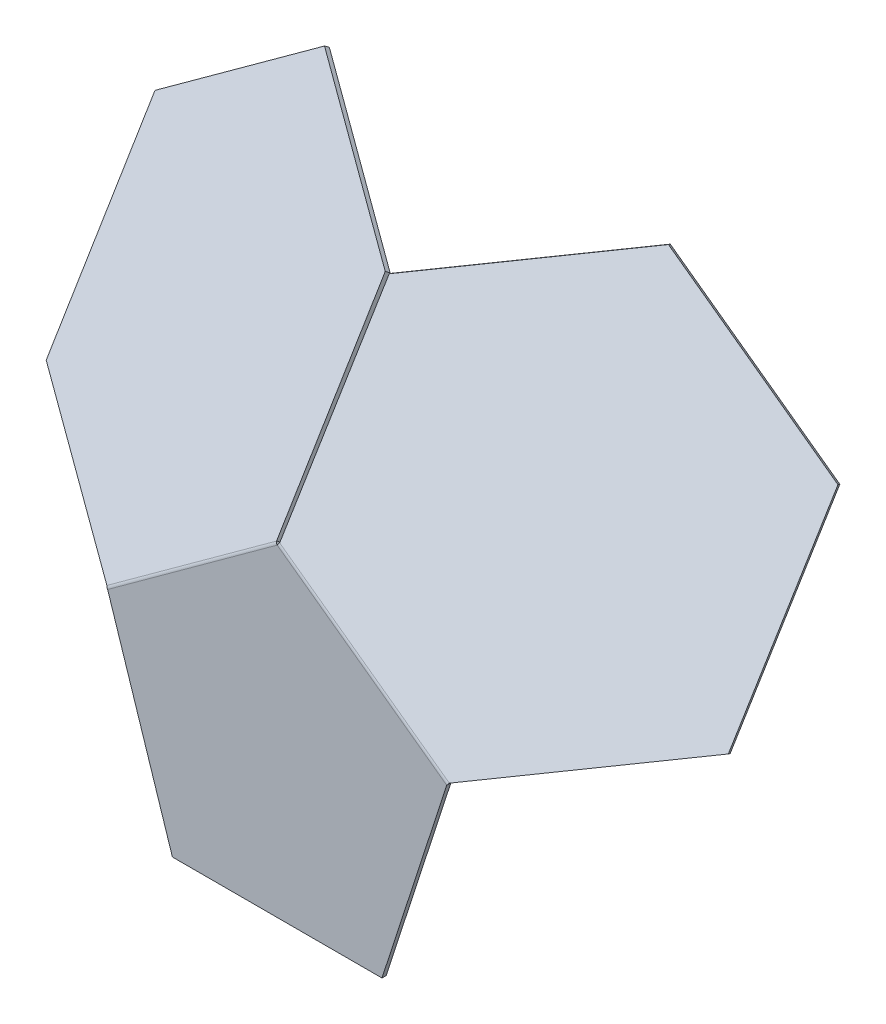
ISO-10303-21;
HEADER;
FILE_DESCRIPTION(('STEP AP214'),'2;1');
FILE_NAME('part.step','',(''),(''),'','','');
FILE_SCHEMA(('AUTOMOTIVE_DESIGN { 1 0 10303 214 1 1 1 1 }'));
ENDSEC;
DATA;
#1=APPLICATION_CONTEXT('core data for automotive mechanical design processes');
#2=APPLICATION_PROTOCOL_DEFINITION('international standard','automotive_design',2000,#1);
#3=PRODUCT_CONTEXT('',#1,'mechanical');
#4=PRODUCT('Part','Part','',(#3));
#5=PRODUCT_RELATED_PRODUCT_CATEGORY('part','',(#4));
#6=PRODUCT_DEFINITION_FORMATION('','',#4);
#7=PRODUCT_DEFINITION_CONTEXT('part definition',#1,'design');
#8=PRODUCT_DEFINITION('design','',#6,#7);
#9=PRODUCT_DEFINITION_SHAPE('','',#8);
#10=(LENGTH_UNIT() NAMED_UNIT(*) SI_UNIT(.MILLI.,.METRE.));
#11=(NAMED_UNIT(*) PLANE_ANGLE_UNIT() SI_UNIT($,.RADIAN.));
#12=(NAMED_UNIT(*) SI_UNIT($,.STERADIAN.) SOLID_ANGLE_UNIT());
#13=UNCERTAINTY_MEASURE_WITH_UNIT(LENGTH_MEASURE(1.E-05),#10,'distance_accuracy_value','');
#14=(GEOMETRIC_REPRESENTATION_CONTEXT(3) GLOBAL_UNCERTAINTY_ASSIGNED_CONTEXT((#13)) GLOBAL_UNIT_ASSIGNED_CONTEXT((#10,
#11,#12)) REPRESENTATION_CONTEXT('',''));
#15=CARTESIAN_POINT('',(0.,0.,0.));
#16=DIRECTION('',(0.,0.,1.));
#17=DIRECTION('',(1.,0.,0.));
#18=AXIS2_PLACEMENT_3D('',#15,#16,#17);
#19=CARTESIAN_POINT('',(-40.4508497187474,13.1432778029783,1.));
#20=DIRECTION('',(0.951056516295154,0.309016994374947,0.));
#21=DIRECTION('',(-0.309016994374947,0.951056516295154,0.));
#22=AXIS2_PLACEMENT_3D('',#19,#20,#21);
#23=PLANE('',#22);
#24=DIRECTION('',(0.309016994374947,-0.951056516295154,0.));
#25=VECTOR('',#24,1.);
#26=CARTESIAN_POINT('',(-40.4508497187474,13.1432778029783,0.));
#27=LINE('',#26,#25);
#28=CARTESIAN_POINT('',(-40.4508497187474,13.1432778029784,0.));
#29=VERTEX_POINT('',#28);
#30=CARTESIAN_POINT('',(-25.,-34.4095480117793,0.));
#31=VERTEX_POINT('',#30);
#32=EDGE_CURVE('E123',#29,#31,#27,.T.);
#33=ORIENTED_EDGE('',*,*,#32,.T.);
#34=DIRECTION('',(0.,0.,-1.));
#35=VECTOR('',#34,1.);
#36=CARTESIAN_POINT('',(-25.,-34.4095480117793,1.));
#37=LINE('',#36,#35);
#38=CARTESIAN_POINT('',(-25.,-34.4095480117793,1.));
#39=VERTEX_POINT('',#38);
#40=EDGE_CURVE('E176',#39,#31,#37,.T.);
#41=ORIENTED_EDGE('',*,*,#40,.F.);
#42=DIRECTION('',(0.309016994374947,-0.951056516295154,0.));
#43=VECTOR('',#42,1.);
#44=CARTESIAN_POINT('',(-40.4508497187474,13.1432778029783,1.));
#45=LINE('',#44,#43);
#46=CARTESIAN_POINT('',(-40.4508497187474,13.1432778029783,1.));
#47=VERTEX_POINT('',#46);
#48=EDGE_CURVE('E178',#47,#39,#45,.T.);
#49=ORIENTED_EDGE('',*,*,#48,.F.);
#50=DIRECTION('',(0.,0.,-1.));
#51=VECTOR('',#50,1.);
#52=CARTESIAN_POINT('',(-40.4508497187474,13.1432778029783,1.));
#53=LINE('',#52,#51);
#54=EDGE_CURVE('E103',#47,#29,#53,.T.);
#55=ORIENTED_EDGE('',*,*,#54,.T.);
#56=EDGE_LOOP('',(#33,#41,#49,#55));
#57=FACE_BOUND('',#56,.T.);
#58=ADVANCED_FACE('F95',(#57),#23,.F.);
#59=CARTESIAN_POINT('',(-25.,-34.4095480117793,1.));
#60=DIRECTION('',(0.,1.,0.));
#61=DIRECTION('',(0.,0.,1.));
#62=AXIS2_PLACEMENT_3D('',#59,#60,#61);
#63=PLANE('',#62);
#64=DIRECTION('',(1.,0.,0.));
#65=VECTOR('',#64,1.);
#66=CARTESIAN_POINT('',(-25.,-34.4095480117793,0.));
#67=LINE('',#66,#65);
#68=CARTESIAN_POINT('',(25.,-34.4095480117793,0.));
#69=VERTEX_POINT('',#68);
#70=EDGE_CURVE('E195',#31,#69,#67,.T.);
#71=ORIENTED_EDGE('',*,*,#70,.T.);
#72=DIRECTION('',(0.,0.,-1.));
#73=VECTOR('',#72,1.);
#74=CARTESIAN_POINT('',(25.,-34.4095480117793,1.));
#75=LINE('',#74,#73);
#76=CARTESIAN_POINT('',(25.,-34.4095480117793,1.));
#77=VERTEX_POINT('',#76);
#78=EDGE_CURVE('E201',#77,#69,#75,.T.);
#79=ORIENTED_EDGE('',*,*,#78,.F.);
#80=DIRECTION('',(1.,0.,0.));
#81=VECTOR('',#80,1.);
#82=CARTESIAN_POINT('',(-25.,-34.4095480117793,1.));
#83=LINE('',#82,#81);
#84=EDGE_CURVE('E111',#39,#77,#83,.T.);
#85=ORIENTED_EDGE('',*,*,#84,.F.);
#86=ORIENTED_EDGE('',*,*,#40,.T.);
#87=EDGE_LOOP('',(#71,#79,#85,#86));
#88=FACE_BOUND('',#87,.T.);
#89=ADVANCED_FACE('F206',(#88),#63,.F.);
#90=CARTESIAN_POINT('',(25.,-34.4095480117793,1.));
#91=DIRECTION('',(-0.951056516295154,0.309016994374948,0.));
#92=DIRECTION('',(-0.309016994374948,-0.951056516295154,0.));
#93=AXIS2_PLACEMENT_3D('',#90,#91,#92);
#94=PLANE('',#93);
#95=DIRECTION('',(0.309016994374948,0.951056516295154,0.));
#96=VECTOR('',#95,1.);
#97=CARTESIAN_POINT('',(25.,-34.4095480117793,0.));
#98=LINE('',#97,#96);
#99=CARTESIAN_POINT('',(40.4508497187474,13.1432778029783,0.));
#100=VERTEX_POINT('',#99);
#101=EDGE_CURVE('E197',#69,#100,#98,.T.);
#102=ORIENTED_EDGE('',*,*,#101,.T.);
#103=DIRECTION('',(0.,0.,-1.));
#104=VECTOR('',#103,1.);
#105=CARTESIAN_POINT('',(40.4508497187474,13.1432778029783,1.));
#106=LINE('',#105,#104);
#107=CARTESIAN_POINT('',(40.4508497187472,13.143277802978,0.999999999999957));
#108=VERTEX_POINT('',#107);
#109=EDGE_CURVE('E186',#108,#100,#106,.T.);
#110=ORIENTED_EDGE('',*,*,#109,.F.);
#111=DIRECTION('',(0.309016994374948,0.951056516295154,0.));
#112=VECTOR('',#111,1.);
#113=CARTESIAN_POINT('',(25.,-34.4095480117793,1.));
#114=LINE('',#113,#112);
#115=EDGE_CURVE('E181',#77,#108,#114,.T.);
#116=ORIENTED_EDGE('',*,*,#115,.F.);
#117=ORIENTED_EDGE('',*,*,#78,.T.);
#118=EDGE_LOOP('',(#102,#110,#116,#117));
#119=FACE_BOUND('',#118,.T.);
#120=ADVANCED_FACE('F214',(#119),#94,.F.);
#121=CARTESIAN_POINT('',(40.4508497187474,13.1432778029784,1.));
#122=DIRECTION('',(0.,0.,-1.));
#123=DIRECTION('',(-1.,0.,0.));
#124=AXIS2_PLACEMENT_3D('',#121,#122,#123);
#125=PLANE('',#124);
#126=DIRECTION('',(-0.809016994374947,0.587785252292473,0.));
#127=VECTOR('',#126,1.);
#128=CARTESIAN_POINT('',(40.4508497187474,13.1432778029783,1.));
#129=LINE('',#128,#127);
#130=CARTESIAN_POINT('',(0.,42.5325404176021,1.0000000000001));
#131=VERTEX_POINT('',#130);
#132=EDGE_CURVE('E133',#108,#131,#129,.T.);
#133=ORIENTED_EDGE('',*,*,#132,.T.);
#134=DIRECTION('',(-0.809016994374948,-0.587785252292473,0.));
#135=VECTOR('',#134,1.);
#136=CARTESIAN_POINT('',(0.,42.532540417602,1.));
#137=LINE('',#136,#135);
#138=EDGE_CURVE('E159',#131,#47,#137,.T.);
#139=ORIENTED_EDGE('',*,*,#138,.T.);
#140=ORIENTED_EDGE('',*,*,#48,.T.);
#141=ORIENTED_EDGE('',*,*,#84,.T.);
#142=ORIENTED_EDGE('',*,*,#115,.T.);
#143=EDGE_LOOP('',(#133,#139,#140,#141,#142));
#144=FACE_BOUND('',#143,.T.);
#145=ADVANCED_FACE('F177',(#144),#125,.F.);
#146=CARTESIAN_POINT('',(40.4508497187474,13.1432778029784,0.));
#147=DIRECTION('',(0.,0.,-1.));
#148=DIRECTION('',(-1.,0.,0.));
#149=AXIS2_PLACEMENT_3D('',#146,#147,#148);
#150=PLANE('',#149);
#151=DIRECTION('',(-0.809016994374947,0.587785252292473,0.));
#152=VECTOR('',#151,1.);
#153=CARTESIAN_POINT('',(40.4508497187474,13.1432778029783,0.));
#154=LINE('',#153,#152);
#155=CARTESIAN_POINT('',(0.,42.532540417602,1.02023424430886E-13));
#156=VERTEX_POINT('',#155);
#157=EDGE_CURVE('E187',#100,#156,#154,.T.);
#158=ORIENTED_EDGE('',*,*,#157,.F.);
#159=ORIENTED_EDGE('',*,*,#101,.F.);
#160=ORIENTED_EDGE('',*,*,#70,.F.);
#161=ORIENTED_EDGE('',*,*,#32,.F.);
#162=DIRECTION('',(-0.809016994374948,-0.587785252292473,0.));
#163=VECTOR('',#162,1.);
#164=CARTESIAN_POINT('',(0.,42.532540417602,0.));
#165=LINE('',#164,#163);
#166=EDGE_CURVE('E190',#156,#29,#165,.T.);
#167=ORIENTED_EDGE('',*,*,#166,.F.);
#168=EDGE_LOOP('',(#158,#159,#160,#161,#167));
#169=FACE_BOUND('',#168,.T.);
#170=ADVANCED_FACE('F210',(#169),#150,.T.);
#171=CARTESIAN_POINT('',(2.36270207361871E-13,42.5325404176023,1.01000000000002));
#172=CARTESIAN_POINT('',(0.135671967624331,42.7302675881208,1.00999999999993));
#173=CARTESIAN_POINT('',(0.269720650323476,42.9256538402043,0.930746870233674));
#174=CARTESIAN_POINT('',(0.377020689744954,43.0843304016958,0.786485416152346));
#175=CARTESIAN_POINT('',(2.33942110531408E-13,42.5325404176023,1.00000000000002));
#176=CARTESIAN_POINT('',(0.134402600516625,42.7285204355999,0.999999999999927));
#177=CARTESIAN_POINT('',(0.267197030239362,42.9221803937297,0.921460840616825));
#178=CARTESIAN_POINT('',(0.373483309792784,43.0794616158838,0.778499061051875));
#179=CARTESIAN_POINT('',(0.,42.532540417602,0.));
#180=CARTESIAN_POINT('',(0.00746588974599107,42.5538051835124,0.));
#181=CARTESIAN_POINT('',(0.0148350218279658,42.5748357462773,-0.00714212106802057));
#182=CARTESIAN_POINT('',(0.0197453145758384,42.5925830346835,-0.0201364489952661));
#183=B_SPLINE_SURFACE_WITH_KNOTS('',1,3,((#171,#172,#173,#174),(#175,#176,#177,#178),(#179,#180,
#181,#182)),.UNSPECIFIED.,.F.,.F.,.F.,(2,1,2),(4,4),(-0.01,0.,1.),(0.,1.),.UNSPECIFIED.);
#184=DIRECTION('',(-0.353737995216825,-0.486878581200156,-0.798635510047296));
#185=VECTOR('',#184,1.);
#186=CARTESIAN_POINT('',(0.373483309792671,43.0794616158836,0.778499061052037));
#187=LINE('',#186,#185);
#188=CARTESIAN_POINT('',(0.0197453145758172,42.5925830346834,-0.0201364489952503));
#189=VERTEX_POINT('',#188);
#190=CARTESIAN_POINT('',(0.373483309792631,43.0794616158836,0.778499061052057));
#191=VERTEX_POINT('',#190);
#192=EDGE_CURVE('E167',#189,#191,#187,.F.);
#193=CARTESIAN_POINT('',(0.,42.532540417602,0.));
#194=CARTESIAN_POINT('',(0.000465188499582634,42.53386539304,1.58696577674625E-08));
#195=CARTESIAN_POINT('',(0.000930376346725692,42.5351903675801,-2.71492543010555E-05));
#196=CARTESIAN_POINT('',(0.00185946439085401,42.5378385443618,-0.000135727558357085));
#197=CARTESIAN_POINT('',(0.00232336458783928,42.5391617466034,-0.000217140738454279));
#198=CARTESIAN_POINT('',(0.00324859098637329,42.5418046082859,-0.000434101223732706));
#199=CARTESIAN_POINT('',(0.00370991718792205,42.5431242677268,-0.000569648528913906));
#200=CARTESIAN_POINT('',(0.00462871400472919,42.5457582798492,-0.000894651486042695));
#201=CARTESIAN_POINT('',(0.00508618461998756,42.5470726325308,-0.00108410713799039));
#202=CARTESIAN_POINT('',(0.00599599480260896,42.5496942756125,-0.00151661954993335));
#203=CARTESIAN_POINT('',(0.00644833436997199,42.5510015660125,-0.00175967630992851));
#204=CARTESIAN_POINT('',(0.0073466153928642,42.5536073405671,-0.00229899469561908));
#205=CARTESIAN_POINT('',(0.00779255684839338,42.5549058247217,-0.00259525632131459));
#206=CARTESIAN_POINT('',(0.00867678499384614,42.5574922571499,-0.00324050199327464));
#207=CARTESIAN_POINT('',(0.00911507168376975,42.5587802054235,-0.00358948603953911));
#208=CARTESIAN_POINT('',(0.00998274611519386,42.561343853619,-0.00433960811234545));
#209=CARTESIAN_POINT('',(0.0104121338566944,42.5626195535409,-0.00474074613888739));
#210=CARTESIAN_POINT('',(0.0112607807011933,42.5651570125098,-0.00559452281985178));
#211=CARTESIAN_POINT('',(0.0116800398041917,42.5664187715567,-0.00604716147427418));
#212=CARTESIAN_POINT('',(0.0125072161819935,42.5689266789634,-0.00700320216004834));
#213=CARTESIAN_POINT('',(0.0129151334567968,42.5701728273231,-0.00750660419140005));
#214=CARTESIAN_POINT('',(0.0137184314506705,42.5726478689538,-0.00856335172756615));
#215=CARTESIAN_POINT('',(0.0141138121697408,42.5738767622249,-0.00911669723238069));
#216=CARTESIAN_POINT('',(0.0148908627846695,42.5763156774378,-0.0102724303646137));
#217=CARTESIAN_POINT('',(0.0152725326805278,42.5775256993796,-0.0108748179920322));
#218=CARTESIAN_POINT('',(0.0160210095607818,42.5799252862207,-0.0121276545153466));
#219=CARTESIAN_POINT('',(0.0163878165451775,42.5811148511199,-0.0127781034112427));
#220=CARTESIAN_POINT('',(0.0171054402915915,42.5834719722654,-0.0141260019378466));
#221=CARTESIAN_POINT('',(0.0174562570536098,42.5846395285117,-0.0148234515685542));
#222=CARTESIAN_POINT('',(0.0181407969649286,42.5869511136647,-0.0162642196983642));
#223=CARTESIAN_POINT('',(0.018474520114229,42.5880951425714,-0.0170075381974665));
#224=CARTESIAN_POINT('',(0.019123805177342,42.5903582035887,-0.0185388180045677));
#225=CARTESIAN_POINT('',(0.0194393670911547,42.5914772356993,-0.0193267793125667));
#226=CARTESIAN_POINT('',(0.0197453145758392,42.5925830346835,-0.0201364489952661));
#227=B_SPLINE_CURVE_WITH_KNOTS('',3,(#193,#194,#195,#196,#197,#198,#199,#200,#201,#202,#203,
#204,#205,#206,#207,#208,#209,#210,#211,#212,#213,#214,#215,#216,#217,#218,#219,#220,#221,#222,
#223,#224,#225,#226),.UNSPECIFIED.,.F.,.F.,(4,2,2,2,2,2,2,2,2,2,2,2,2,2,2,2,4),(0.,
0.00421253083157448,0.00842506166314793,0.0126375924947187,0.0168501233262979,
0.0210626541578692,0.0252751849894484,0.0294877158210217,0.0337002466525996,0.0379127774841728,
0.0421253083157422,0.046337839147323,0.0505503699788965,0.0547629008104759,0.0589754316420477,
0.0631879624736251,0.0674004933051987),.UNSPECIFIED.);
#228=EDGE_CURVE('E231',#156,#189,#227,.T.);
#229=DIRECTION('',(0.,0.,-1.));
#230=VECTOR('',#229,1.);
#231=CARTESIAN_POINT('',(0.,42.532540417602,1.));
#232=LINE('',#231,#230);
#233=EDGE_CURVE('E13',#131,#156,#232,.T.);
#234=CARTESIAN_POINT('',(2.22044604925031E-13,42.5325404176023,1.00000000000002));
#235=CARTESIAN_POINT('',(0.00837300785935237,42.5447495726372,1.00000017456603));
#236=CARTESIAN_POINT('',(0.016746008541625,42.556958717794,0.999701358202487));
#237=CARTESIAN_POINT('',(0.0334778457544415,42.5813575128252,0.998506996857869));
#238=CARTESIAN_POINT('',(0.0418366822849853,42.5935471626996,0.997611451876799));
#239=CARTESIAN_POINT('',(0.0585260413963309,42.6178874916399,0.995224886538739));
#240=CARTESIAN_POINT('',(0.0668565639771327,42.6300381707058,0.993733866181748));
#241=CARTESIAN_POINT('',(0.0834751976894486,42.6542811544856,0.990158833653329));
#242=CARTESIAN_POINT('',(0.0917633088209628,42.6663734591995,0.988074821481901));
#243=CARTESIAN_POINT('',(0.108283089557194,42.6904803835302,0.983317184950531));
#244=CARTESIAN_POINT('',(0.116514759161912,42.702495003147,0.980643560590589));
#245=CARTESIAN_POINT('',(0.132907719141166,42.7264273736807,0.974711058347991));
#246=CARTESIAN_POINT('',(0.141069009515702,42.7383451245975,0.971452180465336));
#247=CARTESIAN_POINT('',(0.157307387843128,42.7620647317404,0.964354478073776));
#248=CARTESIAN_POINT('',(0.165384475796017,42.7738665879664,0.960515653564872));
#249=CARTESIAN_POINT('',(0.181440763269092,42.7973355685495,0.952264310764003));
#250=CARTESIAN_POINT('',(0.189419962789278,42.8090026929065,0.947851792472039));
#251=CARTESIAN_POINT('',(0.205266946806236,42.8321835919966,0.938460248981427));
#252=CARTESIAN_POINT('',(0.213134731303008,42.8436973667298,0.933481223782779));
#253=CARTESIAN_POINT('',(0.22874554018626,42.8665531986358,0.922964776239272));
#254=CARTESIAN_POINT('',(0.236488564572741,42.8778952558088,0.917427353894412));
#255=CARTESIAN_POINT('',(0.251836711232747,42.9003895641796,0.905803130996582));
#256=CARTESIAN_POINT('',(0.259441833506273,42.9115418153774,0.89971633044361));
#257=CARTESIAN_POINT('',(0.274501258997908,42.933638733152,0.887003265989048));
#258=CARTESIAN_POINT('',(0.281955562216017,42.9445833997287,0.880377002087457));
#259=CARTESIAN_POINT('',(0.296700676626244,42.9662477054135,0.866595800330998));
#260=CARTESIAN_POINT('',(0.303991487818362,42.9769673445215,0.85944086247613));
#261=CARTESIAN_POINT('',(0.31839721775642,42.9981645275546,0.844613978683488));
#262=CARTESIAN_POINT('',(0.325512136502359,43.0086420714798,0.836942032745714));
#263=CARTESIAN_POINT('',(0.339553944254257,43.0293383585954,0.82109358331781));
#264=CARTESIAN_POINT('',(0.346480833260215,43.039557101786,0.81291707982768));
#265=CARTESIAN_POINT('',(0.360134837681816,43.0597196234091,0.796073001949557));
#266=CARTESIAN_POINT('',(0.366861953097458,43.0696634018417,0.787405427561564));
#267=CARTESIAN_POINT('',(0.373483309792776,43.0794616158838,0.778499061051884));
#268=B_SPLINE_CURVE_WITH_KNOTS('',3,(#234,#235,#236,#237,#238,#239,#240,#241,#242,#243,#244,
#245,#246,#247,#248,#249,#250,#251,#252,#253,#254,#255,#256,#257,#258,#259,#260,#261,#262,#263,
#264,#265,#266,#267),.UNSPECIFIED.,.F.,.F.,(4,2,2,2,2,2,2,2,2,2,2,2,2,2,2,2,4),(0.,
0.0444102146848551,0.0888204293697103,0.133230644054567,0.177640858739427,0.222051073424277,
0.266461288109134,0.310871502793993,0.355281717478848,0.399691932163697,0.444102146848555,
0.488512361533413,0.532922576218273,0.577332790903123,0.621743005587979,0.666153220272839,
0.710563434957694),.UNSPECIFIED.);
#269=EDGE_CURVE('E191',#131,#191,#268,.T.);
#270=ORIENTED_EDGE('',*,*,#192,.F.);
#271=ORIENTED_EDGE('',*,*,#228,.F.);
#272=ORIENTED_EDGE('',*,*,#233,.F.);
#273=ORIENTED_EDGE('',*,*,#269,.T.);
#274=EDGE_LOOP('',(#270,#271,#272,#273));
#275=FACE_BOUND('',#274,.T.);
#276=ADVANCED_FACE('F257',(#275),#183,.F.);
#277=CARTESIAN_POINT('',(40.8591273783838,13.6723582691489,0.786485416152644));
#278=CARTESIAN_POINT('',(40.7413745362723,13.5212761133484,0.930746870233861));
#279=CARTESIAN_POINT('',(40.5969744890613,13.3334105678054,1.01000000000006));
#280=CARTESIAN_POINT('',(40.4508497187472,13.143277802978,1.00999999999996));
#281=CARTESIAN_POINT('',(40.8555899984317,13.6674894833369,0.77849906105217));
#282=CARTESIAN_POINT('',(40.7388509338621,13.5178026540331,0.921460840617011));
#283=CARTESIAN_POINT('',(40.5957051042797,13.3316634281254,1.00000000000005));
#284=CARTESIAN_POINT('',(40.4508497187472,13.143277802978,0.999999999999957));
#285=CARTESIAN_POINT('',(40.501852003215,13.1806109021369,-0.0201364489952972));
#286=CARTESIAN_POINT('',(40.4864906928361,13.1704567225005,-0.00714212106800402));
#287=CARTESIAN_POINT('',(40.4687666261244,13.156949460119,0.));
#288=CARTESIAN_POINT('',(40.4508497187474,13.1432778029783,0.));
#289=B_SPLINE_SURFACE_WITH_KNOTS('',1,3,((#277,#278,#279,#280),(#281,#282,#283,#284),(#285,#286,
#287,#288)),.UNSPECIFIED.,.F.,.F.,.F.,(2,1,2),(4,4),(-0.01,0.,1.),(0.,1.),.UNSPECIFIED.);
#290=CARTESIAN_POINT('',(40.501852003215,13.1806109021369,-0.0201364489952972));
#291=CARTESIAN_POINT('',(40.5008948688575,13.1799782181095,-0.0193267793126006));
#292=CARTESIAN_POINT('',(40.499928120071,13.1793323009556,-0.018538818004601));
#293=CARTESIAN_POINT('',(40.4979764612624,13.1780154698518,-0.0170075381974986));
#294=CARTESIAN_POINT('',(40.4969915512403,13.1773445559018,-0.0162642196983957));
#295=CARTESIAN_POINT('',(40.4950046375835,13.1759792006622,-0.014823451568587));
#296=CARTESIAN_POINT('',(40.4940026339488,13.1752847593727,-0.0141260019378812));
#297=CARTESIAN_POINT('',(40.4919826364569,13.1738738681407,-0.0127781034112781));
#298=CARTESIAN_POINT('',(40.4909646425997,13.1731574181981,-0.0121276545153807));
#299=CARTESIAN_POINT('',(40.488913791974,13.1717040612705,-0.010874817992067));
#300=CARTESIAN_POINT('',(40.4878809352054,13.1709671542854,-0.0102724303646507));
#301=CARTESIAN_POINT('',(40.485801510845,13.1694744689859,-0.00911669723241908));
#302=CARTESIAN_POINT('',(40.4847549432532,13.1687186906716,-0.00856335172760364));
#303=CARTESIAN_POINT('',(40.4826492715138,13.1671898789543,-0.00750660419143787));
#304=CARTESIAN_POINT('',(40.4815901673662,13.1664168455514,-0.00700320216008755));
#305=CARTESIAN_POINT('',(40.479460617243,13.1648551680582,-0.00604716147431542));
#306=CARTESIAN_POINT('',(40.4783901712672,13.1640665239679,-0.00559452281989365));
#307=CARTESIAN_POINT('',(40.4762391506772,13.1624752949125,-0.00474074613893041));
#308=CARTESIAN_POINT('',(40.475158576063,13.1616727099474,-0.00433960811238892));
#309=CARTESIAN_POINT('',(40.4729885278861,13.1600552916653,-0.00358948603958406));
#310=CARTESIAN_POINT('',(40.4718990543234,13.1592404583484,-0.00324050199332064));
#311=CARTESIAN_POINT('',(40.4697124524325,13.1576002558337,-0.00259525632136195));
#312=CARTESIAN_POINT('',(40.4686153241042,13.1567748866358,-0.00229899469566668));
#313=CARTESIAN_POINT('',(40.4664146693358,13.1551153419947,-0.0017596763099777));
#314=CARTESIAN_POINT('',(40.4653111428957,13.1542811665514,-0.00151661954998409));
#315=CARTESIAN_POINT('',(40.4630989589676,13.1526057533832,-0.00108410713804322));
#316=CARTESIAN_POINT('',(40.4619903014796,13.1517645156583,-0.000894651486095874));
#317=CARTESIAN_POINT('',(40.4597691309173,13.1500767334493,-0.000569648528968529));
#318=CARTESIAN_POINT('',(40.458656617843,13.1492301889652,-0.000434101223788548));
#319=CARTESIAN_POINT('',(40.456429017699,13.1475335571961,-0.000217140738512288));
#320=CARTESIAN_POINT('',(40.4553139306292,13.1466834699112,-0.000135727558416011));
#321=CARTESIAN_POINT('',(40.4530824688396,13.144981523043,-2.71492543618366E-05));
#322=CARTESIAN_POINT('',(40.4519660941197,13.1441296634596,1.5869596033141E-08));
#323=CARTESIAN_POINT('',(40.4508497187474,13.1432778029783,0.));
#324=B_SPLINE_CURVE_WITH_KNOTS('',3,(#290,#291,#292,#293,#294,#295,#296,#297,#298,#299,#300,
#301,#302,#303,#304,#305,#306,#307,#308,#309,#310,#311,#312,#313,#314,#315,#316,#317,#318,#319,
#320,#321,#322,#323),.UNSPECIFIED.,.F.,.F.,(4,2,2,2,2,2,2,2,2,2,2,2,2,2,2,2,4),(0.,
0.00421253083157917,0.00842506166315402,0.0126375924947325,0.0168501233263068,
0.0210626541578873,0.0252751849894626,0.0294877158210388,0.0337002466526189,0.0379127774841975,
0.0421253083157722,0.0463378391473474,0.0505503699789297,0.0547629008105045,0.0589754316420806,
0.0631879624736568,0.0674004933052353),.UNSPECIFIED.);
#325=CARTESIAN_POINT('',(40.501852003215,13.1806109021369,-0.0201364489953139));
#326=VERTEX_POINT('',#325);
#327=EDGE_CURVE('E221',#326,#100,#324,.T.);
#328=DIRECTION('',(-0.353737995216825,-0.486878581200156,-0.798635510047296));
#329=VECTOR('',#328,1.);
#330=CARTESIAN_POINT('',(40.501852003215,13.1806109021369,-0.0201364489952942));
#331=LINE('',#330,#329);
#332=CARTESIAN_POINT('',(40.8555899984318,13.6674894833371,0.778499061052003));
#333=VERTEX_POINT('',#332);
#334=EDGE_CURVE('E272',#326,#333,#331,.F.);
#335=CARTESIAN_POINT('',(40.8555899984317,13.6674894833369,0.778499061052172));
#336=CARTESIAN_POINT('',(40.8483174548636,13.6581643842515,0.787405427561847));
#337=CARTESIAN_POINT('',(40.8409391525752,13.6486937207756,0.796073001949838));
#338=CARTESIAN_POINT('',(40.8259827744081,13.6294774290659,0.812917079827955));
#339=CARTESIAN_POINT('',(40.8184046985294,13.6197318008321,0.821093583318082));
#340=CARTESIAN_POINT('',(40.803060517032,13.5999817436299,0.836942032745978));
#341=CARTESIAN_POINT('',(40.7952944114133,13.5899773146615,0.844613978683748));
#342=CARTESIAN_POINT('',(40.7795863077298,13.5697263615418,0.85944086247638));
#343=CARTESIAN_POINT('',(40.7716443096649,13.5594798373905,0.866595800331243));
#344=CARTESIAN_POINT('',(40.7555968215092,13.5387617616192,0.880377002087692));
#345=CARTESIAN_POINT('',(40.7474913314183,13.5282902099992,0.887003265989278));
#346=CARTESIAN_POINT('',(40.7311295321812,13.5071395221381,0.899716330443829));
#347=CARTESIAN_POINT('',(40.7228732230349,13.4964603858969,0.905803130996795));
#348=CARTESIAN_POINT('',(40.7062227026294,13.4749123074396,0.917427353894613));
#349=CARTESIAN_POINT('',(40.6978284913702,13.4640433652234,0.922964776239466));
#350=CARTESIAN_POINT('',(40.6809153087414,13.4421337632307,0.93348122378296));
#351=CARTESIAN_POINT('',(40.6723963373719,13.4310931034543,0.938460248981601));
#352=CARTESIAN_POINT('',(40.6552469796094,13.4088584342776,0.947851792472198));
#353=CARTESIAN_POINT('',(40.6466165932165,13.3976644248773,0.952264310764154));
#354=CARTESIAN_POINT('',(40.6292579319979,13.3751416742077,0.960515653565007));
#355=CARTESIAN_POINT('',(40.6205296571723,13.3638129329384,0.964354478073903));
#356=CARTESIAN_POINT('',(40.6029889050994,13.341039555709,0.971452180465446));
#357=CARTESIAN_POINT('',(40.5941764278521,13.3295949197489,0.974711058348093));
#358=CARTESIAN_POINT('',(40.5764810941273,13.3066087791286,0.980643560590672));
#359=CARTESIAN_POINT('',(40.5675982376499,13.2950672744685,0.983317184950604));
#360=CARTESIAN_POINT('',(40.5497760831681,13.2719065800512,0.988074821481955));
#361=CARTESIAN_POINT('',(40.5408367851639,13.2602873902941,0.990158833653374));
#362=CARTESIAN_POINT('',(40.5229157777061,13.2369906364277,0.993733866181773));
#363=CARTESIAN_POINT('',(40.5139340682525,13.2253130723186,0.995224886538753));
#364=CARTESIAN_POINT('',(40.4959423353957,13.2019189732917,0.997611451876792));
#365=CARTESIAN_POINT('',(40.4869323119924,13.190202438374,0.998506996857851));
#366=CARTESIAN_POINT('',(40.4688981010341,13.1667498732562,0.999701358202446));
#367=CARTESIAN_POINT('',(40.4598739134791,13.1550138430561,1.00000017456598));
#368=CARTESIAN_POINT('',(40.4508497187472,13.143277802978,0.999999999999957));
#369=B_SPLINE_CURVE_WITH_KNOTS('',3,(#335,#336,#337,#338,#339,#340,#341,#342,#343,#344,#345,
#346,#347,#348,#349,#350,#351,#352,#353,#354,#355,#356,#357,#358,#359,#360,#361,#362,#363,#364,
#365,#366,#367,#368),.UNSPECIFIED.,.F.,.F.,(4,2,2,2,2,2,2,2,2,2,2,2,2,2,2,2,4),(0.,
0.0444102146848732,0.0888204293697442,0.133230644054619,0.177640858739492,0.222051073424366,
0.266461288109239,0.31087150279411,0.355281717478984,0.39969193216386,0.444102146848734,
0.488512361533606,0.532922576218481,0.57733279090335,0.621743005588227,0.666153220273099,
0.710563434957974),.UNSPECIFIED.);
#370=EDGE_CURVE('E223',#333,#108,#369,.T.);
#371=ORIENTED_EDGE('',*,*,#327,.F.);
#372=ORIENTED_EDGE('',*,*,#334,.T.);
#373=ORIENTED_EDGE('',*,*,#370,.T.);
#374=ORIENTED_EDGE('',*,*,#109,.T.);
#375=EDGE_LOOP('',(#371,#372,#373,#374));
#376=FACE_BOUND('',#375,.T.);
#377=ADVANCED_FACE('F219',(#376),#289,.F.);
#378=CARTESIAN_POINT('',(40.4664782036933,13.1319230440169,-0.10000000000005));
#379=DIRECTION('',(0.809016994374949,-0.587785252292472,0.));
#380=DIRECTION('',(0.353737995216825,0.486878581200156,0.798635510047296));
#381=AXIS2_PLACEMENT_3D('',#378,#379,#380);
#382=CYLINDRICAL_SURFACE('',#381,1.10000000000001);
#383=ORIENTED_EDGE('',*,*,#132,.F.);
#384=ORIENTED_EDGE('',*,*,#370,.F.);
#385=DIRECTION('',(0.809016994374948,-0.587785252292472,0.));
#386=VECTOR('',#385,1.);
#387=CARTESIAN_POINT('',(0.37348330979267,43.0794616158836,0.778499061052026));
#388=LINE('',#387,#386);
#389=EDGE_CURVE('E274',#333,#191,#388,.F.);
#390=ORIENTED_EDGE('',*,*,#389,.T.);
#391=ORIENTED_EDGE('',*,*,#269,.F.);
#392=EDGE_LOOP('',(#383,#384,#390,#391));
#393=FACE_BOUND('',#392,.T.);
#394=ADVANCED_FACE('F254',(#393),#382,.T.);
#395=CARTESIAN_POINT('',(40.4664782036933,13.1319230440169,-0.10000000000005));
#396=DIRECTION('',(0.809016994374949,-0.587785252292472,0.));
#397=DIRECTION('',(0.353737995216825,0.486878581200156,0.798635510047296));
#398=AXIS2_PLACEMENT_3D('',#395,#396,#397);
#399=CYLINDRICAL_SURFACE('',#398,0.100000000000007);
#400=ORIENTED_EDGE('',*,*,#157,.T.);
#401=ORIENTED_EDGE('',*,*,#228,.T.);
#402=DIRECTION('',(0.809016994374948,-0.587785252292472,0.));
#403=VECTOR('',#402,1.);
#404=CARTESIAN_POINT('',(0.0197453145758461,42.5925830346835,-0.0201364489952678));
#405=LINE('',#404,#403);
#406=EDGE_CURVE('E230',#189,#326,#405,.T.);
#407=ORIENTED_EDGE('',*,*,#406,.T.);
#408=ORIENTED_EDGE('',*,*,#327,.T.);
#409=EDGE_LOOP('',(#400,#401,#407,#408));
#410=FACE_BOUND('',#409,.T.);
#411=ADVANCED_FACE('F225',(#410),#399,.F.);
#412=CARTESIAN_POINT('',(0.474729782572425,85.7184903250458,-25.2607194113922));
#413=DIRECTION('',(0.935342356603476,-0.185982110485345,-0.300907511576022));
#414=DIRECTION('',(-0.306250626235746,0.,-0.95195091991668));
#415=AXIS2_PLACEMENT_3D('',#412,#413,#414);
#416=PLANE('',#415);
#417=ORIENTED_EDGE('',*,*,#192,.T.);
#418=DIRECTION('',(-0.00202649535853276,-0.853440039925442,0.521187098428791));
#419=VECTOR('',#418,1.);
#420=CARTESIAN_POINT('',(0.272080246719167,0.374486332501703,26.8579904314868));
#421=LINE('',#420,#419);
#422=CARTESIAN_POINT('',(0.474729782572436,85.7184903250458,-25.2607194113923));
#423=VERTEX_POINT('',#422);
#424=EDGE_CURVE('E300',#423,#191,#421,.T.);
#425=ORIENTED_EDGE('',*,*,#424,.F.);
#426=DIRECTION('',(-0.353737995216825,-0.486878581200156,-0.798635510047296));
#427=VECTOR('',#426,1.);
#428=CARTESIAN_POINT('',(0.474729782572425,85.7184903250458,-25.2607194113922));
#429=LINE('',#428,#427);
#430=CARTESIAN_POINT('',(0.120991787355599,85.2316117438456,-26.0593549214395));
#431=VERTEX_POINT('',#430);
#432=EDGE_CURVE('E309',#423,#431,#429,.T.);
#433=ORIENTED_EDGE('',*,*,#432,.T.);
#434=DIRECTION('',(0.00202649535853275,0.853440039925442,-0.521187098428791));
#435=VECTOR('',#434,1.);
#436=CARTESIAN_POINT('',(0.120991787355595,85.2316117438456,-26.0593549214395));
#437=LINE('',#436,#435);
#438=EDGE_CURVE('E285',#431,#189,#437,.F.);
#439=ORIENTED_EDGE('',*,*,#438,.T.);
#440=EDGE_LOOP('',(#417,#425,#433,#439));
#441=FACE_BOUND('',#440,.T.);
#442=ADVANCED_FACE('F253',(#441),#416,.F.);
#443=CARTESIAN_POINT('',(40.8242547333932,13.65722571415,0.798635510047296));
#444=DIRECTION('',(-0.465916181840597,0.832091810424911,-0.300907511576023));
#445=DIRECTION('',(-0.872530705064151,-0.488559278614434,0.));
#446=AXIS2_PLACEMENT_3D('',#443,#444,#445);
#447=PLANE('',#446);
#448=ORIENTED_EDGE('',*,*,#334,.F.);
#449=DIRECTION('',(-0.81104348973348,-0.265654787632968,0.52118709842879));
#450=VECTOR('',#449,1.);
#451=CARTESIAN_POINT('',(40.4705167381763,13.1703471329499,0.));
#452=LINE('',#451,#450);
#453=CARTESIAN_POINT('',(81.0226912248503,26.4530865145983,-26.0593549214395));
#454=VERTEX_POINT('',#453);
#455=EDGE_CURVE('E288',#326,#454,#452,.F.);
#456=ORIENTED_EDGE('',*,*,#455,.T.);
#457=DIRECTION('',(-0.353737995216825,-0.486878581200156,-0.798635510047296));
#458=VECTOR('',#457,1.);
#459=CARTESIAN_POINT('',(81.3764292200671,26.9399650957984,-25.2607194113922));
#460=LINE('',#459,#458);
#461=CARTESIAN_POINT('',(81.3764292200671,26.9399650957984,-25.2607194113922));
#462=VERTEX_POINT('',#461);
#463=EDGE_CURVE('E306',#462,#454,#460,.T.);
#464=ORIENTED_EDGE('',*,*,#463,.F.);
#465=DIRECTION('',(0.81104348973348,0.265654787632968,-0.52118709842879));
#466=VECTOR('',#465,1.);
#467=CARTESIAN_POINT('',(61.1003419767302,20.2985954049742,-12.2310419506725));
#468=LINE('',#467,#466);
#469=EDGE_CURVE('E303',#333,#462,#468,.T.);
#470=ORIENTED_EDGE('',*,*,#469,.F.);
#471=EDGE_LOOP('',(#448,#456,#464,#470));
#472=FACE_BOUND('',#471,.T.);
#473=ADVANCED_FACE('F472',(#472),#447,.F.);
#474=CARTESIAN_POINT('',(81.2751044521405,-15.7320369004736,0.798635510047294));
#475=DIRECTION('',(-0.353737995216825,-0.486878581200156,-0.798635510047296));
#476=DIRECTION('',(0.,0.853840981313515,-0.520533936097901));
#477=AXIS2_PLACEMENT_3D('',#474,#475,#476);
#478=PLANE('',#477);
#479=ORIENTED_EDGE('',*,*,#389,.F.);
#480=ORIENTED_EDGE('',*,*,#469,.T.);
#481=DIRECTION('',(0.00202649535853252,0.853440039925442,-0.521187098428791));
#482=VECTOR('',#481,1.);
#483=CARTESIAN_POINT('',(81.2751044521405,-15.7320369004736,0.798635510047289));
#484=LINE('',#483,#482);
#485=CARTESIAN_POINT('',(81.4777539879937,69.6119670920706,-51.3200743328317));
#486=VERTEX_POINT('',#485);
#487=EDGE_CURVE('E291',#462,#486,#484,.T.);
#488=ORIENTED_EDGE('',*,*,#487,.T.);
#489=DIRECTION('',(-0.809016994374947,0.587785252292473,0.));
#490=VECTOR('',#489,1.);
#491=CARTESIAN_POINT('',(121.928603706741,40.2227044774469,-51.3200743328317));
#492=LINE('',#491,#490);
#493=CARTESIAN_POINT('',(41.0269042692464,99.0012297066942,-51.3200743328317));
#494=VERTEX_POINT('',#493);
#495=EDGE_CURVE('E294',#486,#494,#492,.T.);
#496=ORIENTED_EDGE('',*,*,#495,.T.);
#497=DIRECTION('',(-0.81104348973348,-0.265654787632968,0.52118709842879));
#498=VECTOR('',#497,1.);
#499=CARTESIAN_POINT('',(20.7508170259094,92.35986001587,-38.290396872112));
#500=LINE('',#499,#498);
#501=EDGE_CURVE('E297',#494,#423,#500,.T.);
#502=ORIENTED_EDGE('',*,*,#501,.T.);
#503=ORIENTED_EDGE('',*,*,#424,.T.);
#504=EDGE_LOOP('',(#479,#480,#488,#496,#502,#503));
#505=FACE_BOUND('',#504,.T.);
#506=ADVANCED_FACE('F469',(#505),#478,.F.);
#507=CARTESIAN_POINT('',(80.9213664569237,-16.2189154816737,0.));
#508=DIRECTION('',(-0.353737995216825,-0.486878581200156,-0.798635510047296));
#509=DIRECTION('',(0.,0.853840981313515,-0.520533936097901));
#510=AXIS2_PLACEMENT_3D('',#507,#508,#509);
#511=PLANE('',#510);
#512=ORIENTED_EDGE('',*,*,#455,.F.);
#513=ORIENTED_EDGE('',*,*,#406,.F.);
#514=ORIENTED_EDGE('',*,*,#438,.F.);
#515=DIRECTION('',(0.81104348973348,0.265654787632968,-0.52118709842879));
#516=VECTOR('',#515,1.);
#517=CARTESIAN_POINT('',(40.6731662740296,98.5143511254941,-52.118709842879));
#518=LINE('',#517,#516);
#519=CARTESIAN_POINT('',(40.6731662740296,98.5143511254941,-52.118709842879));
#520=VERTEX_POINT('',#519);
#521=EDGE_CURVE('E282',#520,#431,#518,.F.);
#522=ORIENTED_EDGE('',*,*,#521,.F.);
#523=DIRECTION('',(0.809016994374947,-0.587785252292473,0.));
#524=VECTOR('',#523,1.);
#525=CARTESIAN_POINT('',(81.1240159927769,69.1250885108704,-52.118709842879));
#526=LINE('',#525,#524);
#527=CARTESIAN_POINT('',(81.1240159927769,69.1250885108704,-52.118709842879));
#528=VERTEX_POINT('',#527);
#529=EDGE_CURVE('E279',#528,#520,#526,.F.);
#530=ORIENTED_EDGE('',*,*,#529,.F.);
#531=DIRECTION('',(-0.00202649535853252,-0.853440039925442,0.521187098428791));
#532=VECTOR('',#531,1.);
#533=CARTESIAN_POINT('',(81.0226912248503,26.4530865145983,-26.0593549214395));
#534=LINE('',#533,#532);
#535=EDGE_CURVE('E276',#454,#528,#534,.F.);
#536=ORIENTED_EDGE('',*,*,#535,.F.);
#537=EDGE_LOOP('',(#512,#513,#514,#522,#530,#536));
#538=FACE_BOUND('',#537,.T.);
#539=ADVANCED_FACE('F490',(#538),#511,.T.);
#540=CARTESIAN_POINT('',(81.3764292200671,26.9399650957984,-25.2607194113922));
#541=DIRECTION('',(-0.935342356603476,0.185982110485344,0.300907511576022));
#542=DIRECTION('',(0.306250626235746,0.,0.95195091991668));
#543=AXIS2_PLACEMENT_3D('',#540,#541,#542);
#544=PLANE('',#543);
#545=ORIENTED_EDGE('',*,*,#535,.T.);
#546=DIRECTION('',(-0.353737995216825,-0.486878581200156,-0.798635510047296));
#547=VECTOR('',#546,1.);
#548=CARTESIAN_POINT('',(81.4777539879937,69.6119670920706,-51.3200743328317));
#549=LINE('',#548,#547);
#550=EDGE_CURVE('E232',#486,#528,#549,.T.);
#551=ORIENTED_EDGE('',*,*,#550,.F.);
#552=ORIENTED_EDGE('',*,*,#487,.F.);
#553=ORIENTED_EDGE('',*,*,#463,.T.);
#554=EDGE_LOOP('',(#545,#551,#552,#553));
#555=FACE_BOUND('',#554,.T.);
#556=ADVANCED_FACE('F477',(#555),#544,.F.);
#557=CARTESIAN_POINT('',(81.4777539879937,69.6119670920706,-51.3200743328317));
#558=DIRECTION('',(-0.469426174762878,-0.646109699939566,0.601815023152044));
#559=DIRECTION('',(0.,-0.681579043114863,-0.731744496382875));
#560=AXIS2_PLACEMENT_3D('',#557,#558,#559);
#561=PLANE('',#560);
#562=ORIENTED_EDGE('',*,*,#529,.T.);
#563=DIRECTION('',(-0.353737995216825,-0.486878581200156,-0.798635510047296));
#564=VECTOR('',#563,1.);
#565=CARTESIAN_POINT('',(41.0269042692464,99.0012297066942,-51.3200743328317));
#566=LINE('',#565,#564);
#567=EDGE_CURVE('E236',#494,#520,#566,.T.);
#568=ORIENTED_EDGE('',*,*,#567,.F.);
#569=ORIENTED_EDGE('',*,*,#495,.F.);
#570=ORIENTED_EDGE('',*,*,#550,.T.);
#571=EDGE_LOOP('',(#562,#568,#569,#570));
#572=FACE_BOUND('',#571,.T.);
#573=ADVANCED_FACE('F482',(#572),#561,.F.);
#574=CARTESIAN_POINT('',(41.0269042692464,99.0012297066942,-51.3200743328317));
#575=DIRECTION('',(0.465916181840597,-0.832091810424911,0.300907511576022));
#576=DIRECTION('',(0.87253070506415,0.488559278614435,0.));
#577=AXIS2_PLACEMENT_3D('',#574,#575,#576);
#578=PLANE('',#577);
#579=ORIENTED_EDGE('',*,*,#521,.T.);
#580=ORIENTED_EDGE('',*,*,#432,.F.);
#581=ORIENTED_EDGE('',*,*,#501,.F.);
#582=ORIENTED_EDGE('',*,*,#567,.T.);
#583=EDGE_LOOP('',(#579,#580,#581,#582));
#584=FACE_BOUND('',#583,.T.);
#585=ADVANCED_FACE('F485',(#584),#578,.F.);
#586=CARTESIAN_POINT('',(-40.4508497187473,13.1432778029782,1.01));
#587=CARTESIAN_POINT('',(-40.5969744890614,13.3334105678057,1.01000000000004));
#588=CARTESIAN_POINT('',(-40.7413745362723,13.5212761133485,0.93074687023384));
#589=CARTESIAN_POINT('',(-40.8591273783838,13.6723582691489,0.786485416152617));
#590=CARTESIAN_POINT('',(-40.4508497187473,13.1432778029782,1.));
#591=CARTESIAN_POINT('',(-40.5957051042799,13.3316634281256,1.00000000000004));
#592=CARTESIAN_POINT('',(-40.7388509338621,13.5178026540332,0.92146084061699));
#593=CARTESIAN_POINT('',(-40.8555899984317,13.6674894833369,0.778499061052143));
#594=CARTESIAN_POINT('',(-40.4508497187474,13.1432778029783,0.));
#595=CARTESIAN_POINT('',(-40.4687666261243,13.1569494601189,0.));
#596=CARTESIAN_POINT('',(-40.4864906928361,13.1704567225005,-0.00714212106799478));
#597=CARTESIAN_POINT('',(-40.5018520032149,13.1806109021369,-0.0201364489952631));
#598=B_SPLINE_SURFACE_WITH_KNOTS('',1,3,((#586,#587,#588,#589),(#590,#591,#592,#593),(#594,#595,
#596,#597)),.UNSPECIFIED.,.F.,.F.,.F.,(2,1,2),(4,4),(-0.01,0.,1.),(0.,1.),.UNSPECIFIED.);
#599=DIRECTION('',(0.353737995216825,-0.486878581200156,-0.798635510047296));
#600=VECTOR('',#599,1.);
#601=CARTESIAN_POINT('',(-40.8555899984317,13.667489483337,0.778499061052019));
#602=LINE('',#601,#600);
#603=CARTESIAN_POINT('',(-40.5018520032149,13.1806109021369,-0.0201364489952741));
#604=VERTEX_POINT('',#603);
#605=CARTESIAN_POINT('',(-40.8555899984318,13.667489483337,0.778499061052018));
#606=VERTEX_POINT('',#605);
#607=EDGE_CURVE('E344',#604,#606,#602,.F.);
#608=CARTESIAN_POINT('',(-40.4508497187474,13.1432778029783,0.));
#609=CARTESIAN_POINT('',(-40.4519660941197,13.1441296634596,1.5869638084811E-08));
#610=CARTESIAN_POINT('',(-40.4530824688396,13.1449815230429,-2.71492543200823E-05));
#611=CARTESIAN_POINT('',(-40.4553139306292,13.1466834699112,-0.000135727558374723));
#612=CARTESIAN_POINT('',(-40.4564290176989,13.1475335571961,-0.000217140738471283));
#613=CARTESIAN_POINT('',(-40.458656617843,13.1492301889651,-0.000434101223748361));
#614=CARTESIAN_POINT('',(-40.4597691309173,13.1500767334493,-0.000569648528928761));
#615=CARTESIAN_POINT('',(-40.4619903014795,13.1517645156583,-0.000894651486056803));
#616=CARTESIAN_POINT('',(-40.4630989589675,13.1526057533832,-0.00108410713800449));
#617=CARTESIAN_POINT('',(-40.4653111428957,13.1542811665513,-0.00151661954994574));
#618=CARTESIAN_POINT('',(-40.4664146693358,13.1551153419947,-0.00175967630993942));
#619=CARTESIAN_POINT('',(-40.4686153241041,13.1567748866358,-0.00229899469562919));
#620=CARTESIAN_POINT('',(-40.4697124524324,13.1576002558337,-0.00259525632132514));
#621=CARTESIAN_POINT('',(-40.4718990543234,13.1592404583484,-0.00324050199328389));
#622=CARTESIAN_POINT('',(-40.472988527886,13.1600552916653,-0.00358948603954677));
#623=CARTESIAN_POINT('',(-40.4751585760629,13.1616727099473,-0.00433960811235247));
#624=CARTESIAN_POINT('',(-40.4762391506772,13.1624752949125,-0.00474074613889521));
#625=CARTESIAN_POINT('',(-40.4783901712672,13.1640665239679,-0.00559452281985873));
#626=CARTESIAN_POINT('',(-40.4794606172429,13.1648551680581,-0.00604716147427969));
#627=CARTESIAN_POINT('',(-40.4815901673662,13.1664168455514,-0.00700320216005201));
#628=CARTESIAN_POINT('',(-40.4826492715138,13.1671898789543,-0.00750660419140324));
#629=CARTESIAN_POINT('',(-40.4847549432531,13.1687186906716,-0.00856335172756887));
#630=CARTESIAN_POINT('',(-40.4858015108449,13.1694744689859,-0.00911669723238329));
#631=CARTESIAN_POINT('',(-40.4878809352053,13.1709671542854,-0.0102724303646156));
#632=CARTESIAN_POINT('',(-40.4889137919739,13.1717040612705,-0.0108748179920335));
#633=CARTESIAN_POINT('',(-40.4909646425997,13.1731574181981,-0.0121276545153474));
#634=CARTESIAN_POINT('',(-40.4919826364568,13.1738738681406,-0.0127781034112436));
#635=CARTESIAN_POINT('',(-40.4940026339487,13.1752847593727,-0.0141260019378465));
#636=CARTESIAN_POINT('',(-40.4950046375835,13.1759792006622,-0.0148234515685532));
#637=CARTESIAN_POINT('',(-40.4969915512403,13.1773445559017,-0.0162642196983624));
#638=CARTESIAN_POINT('',(-40.4979764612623,13.1780154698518,-0.017007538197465));
#639=CARTESIAN_POINT('',(-40.4999281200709,13.1793323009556,-0.0185388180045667));
#640=CARTESIAN_POINT('',(-40.5008948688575,13.1799782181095,-0.019326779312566));
#641=CARTESIAN_POINT('',(-40.5018520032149,13.1806109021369,-0.0201364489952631));
#642=B_SPLINE_CURVE_WITH_KNOTS('',3,(#608,#609,#610,#611,#612,#613,#614,#615,#616,#617,#618,
#619,#620,#621,#622,#623,#624,#625,#626,#627,#628,#629,#630,#631,#632,#633,#634,#635,#636,#637,
#638,#639,#640,#641),.UNSPECIFIED.,.F.,.F.,(4,2,2,2,2,2,2,2,2,2,2,2,2,2,2,2,4),(0.,
0.00421253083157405,0.00842506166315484,0.0126375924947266,0.0168501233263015,
0.0210626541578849,0.0252751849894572,0.0294877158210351,0.0337002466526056,0.0379127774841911,
0.0421253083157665,0.0463378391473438,0.0505503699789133,0.0547629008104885,0.0589754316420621,
0.0631879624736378,0.0674004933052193),.UNSPECIFIED.);
#643=EDGE_CURVE('E174',#29,#604,#642,.T.);
#644=CARTESIAN_POINT('',(-40.4508497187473,13.1432778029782,1.));
#645=CARTESIAN_POINT('',(-40.4598739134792,13.1550138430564,1.00000017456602));
#646=CARTESIAN_POINT('',(-40.4688981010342,13.1667498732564,0.99970135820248));
#647=CARTESIAN_POINT('',(-40.4869323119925,13.1902024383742,0.998506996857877));
#648=CARTESIAN_POINT('',(-40.4959423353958,13.2019189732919,0.997611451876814));
#649=CARTESIAN_POINT('',(-40.5139340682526,13.2253130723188,0.995224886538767));
#650=CARTESIAN_POINT('',(-40.5229157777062,13.2369906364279,0.993733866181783));
#651=CARTESIAN_POINT('',(-40.540836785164,13.2602873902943,0.990158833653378));
#652=CARTESIAN_POINT('',(-40.5497760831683,13.2719065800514,0.988074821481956));
#653=CARTESIAN_POINT('',(-40.56759823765,13.2950672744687,0.983317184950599));
#654=CARTESIAN_POINT('',(-40.5764810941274,13.3066087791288,0.980643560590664));
#655=CARTESIAN_POINT('',(-40.5941764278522,13.329594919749,0.974711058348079));
#656=CARTESIAN_POINT('',(-40.6029889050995,13.3410395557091,0.97145218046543));
#657=CARTESIAN_POINT('',(-40.6205296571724,13.3638129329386,0.964354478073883));
#658=CARTESIAN_POINT('',(-40.629257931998,13.3751416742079,0.960515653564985));
#659=CARTESIAN_POINT('',(-40.6466165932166,13.3976644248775,0.952264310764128));
#660=CARTESIAN_POINT('',(-40.6552469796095,13.4088584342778,0.947851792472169));
#661=CARTESIAN_POINT('',(-40.6723963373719,13.4310931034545,0.938460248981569));
#662=CARTESIAN_POINT('',(-40.6809153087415,13.4421337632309,0.933481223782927));
#663=CARTESIAN_POINT('',(-40.6978284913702,13.4640433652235,0.922964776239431));
#664=CARTESIAN_POINT('',(-40.7062227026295,13.4749123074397,0.917427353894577));
#665=CARTESIAN_POINT('',(-40.722873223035,13.496460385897,0.905803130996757));
#666=CARTESIAN_POINT('',(-40.7311295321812,13.5071395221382,0.899716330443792));
#667=CARTESIAN_POINT('',(-40.7474913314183,13.5282902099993,0.887003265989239));
#668=CARTESIAN_POINT('',(-40.7555968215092,13.5387617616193,0.880377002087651));
#669=CARTESIAN_POINT('',(-40.7716443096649,13.5594798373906,0.866595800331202));
#670=CARTESIAN_POINT('',(-40.7795863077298,13.5697263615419,0.85944086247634));
#671=CARTESIAN_POINT('',(-40.7952944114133,13.5899773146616,0.844613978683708));
#672=CARTESIAN_POINT('',(-40.803060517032,13.59998174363,0.836942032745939));
#673=CARTESIAN_POINT('',(-40.8184046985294,13.6197318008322,0.821093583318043));
#674=CARTESIAN_POINT('',(-40.8259827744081,13.629477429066,0.812917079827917));
#675=CARTESIAN_POINT('',(-40.8409391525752,13.6486937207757,0.796073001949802));
#676=CARTESIAN_POINT('',(-40.8483174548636,13.6581643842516,0.787405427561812));
#677=CARTESIAN_POINT('',(-40.8555899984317,13.6674894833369,0.778499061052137));
#678=B_SPLINE_CURVE_WITH_KNOTS('',3,(#644,#645,#646,#647,#648,#649,#650,#651,#652,#653,#654,
#655,#656,#657,#658,#659,#660,#661,#662,#663,#664,#665,#666,#667,#668,#669,#670,#671,#672,#673,
#674,#675,#676,#677),.UNSPECIFIED.,.F.,.F.,(4,2,2,2,2,2,2,2,2,2,2,2,2,2,2,2,4),(0.,
0.0444102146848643,0.0888204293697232,0.133230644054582,0.177640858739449,0.22205107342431,
0.266461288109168,0.310871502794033,0.355281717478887,0.399691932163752,0.444102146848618,
0.488512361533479,0.532922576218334,0.577332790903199,0.62174300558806,0.666153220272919,
0.710563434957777),.UNSPECIFIED.);
#679=EDGE_CURVE('E153',#47,#606,#678,.T.);
#680=ORIENTED_EDGE('',*,*,#607,.F.);
#681=ORIENTED_EDGE('',*,*,#643,.F.);
#682=ORIENTED_EDGE('',*,*,#54,.F.);
#683=ORIENTED_EDGE('',*,*,#679,.T.);
#684=EDGE_LOOP('',(#680,#681,#682,#683));
#685=FACE_BOUND('',#684,.T.);
#686=ADVANCED_FACE('F171',(#685),#598,.F.);
#687=CARTESIAN_POINT('',(-0.377020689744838,43.0843304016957,0.786485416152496));
#688=CARTESIAN_POINT('',(-0.26972065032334,42.9256538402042,0.930746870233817));
#689=CARTESIAN_POINT('',(-0.135671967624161,42.7302675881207,1.01000000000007));
#690=CARTESIAN_POINT('',(0.,42.5325404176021,1.0100000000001));
#691=CARTESIAN_POINT('',(-0.373483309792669,43.0794616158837,0.778499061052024));
#692=CARTESIAN_POINT('',(-0.267197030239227,42.9221803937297,0.921460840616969));
#693=CARTESIAN_POINT('',(-0.134402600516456,42.7285204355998,1.00000000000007));
#694=CARTESIAN_POINT('',(0.,42.5325404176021,1.0000000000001));
#695=CARTESIAN_POINT('',(-0.0197453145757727,42.5925830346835,-0.0201364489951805));
#696=CARTESIAN_POINT('',(-0.0148350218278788,42.5748357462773,-0.00714212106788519));
#697=CARTESIAN_POINT('',(-0.00746588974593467,42.5538051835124,0.));
#698=CARTESIAN_POINT('',(0.,42.532540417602,1.0200987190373E-13));
#699=B_SPLINE_SURFACE_WITH_KNOTS('',1,3,((#687,#688,#689,#690),(#691,#692,#693,#694),(#695,#696,
#697,#698)),.UNSPECIFIED.,.F.,.F.,.F.,(2,1,2),(4,4),(-0.01,0.,1.),(0.,1.),.UNSPECIFIED.);
#700=CARTESIAN_POINT('',(-0.0197453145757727,42.5925830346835,-0.0201364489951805));
#701=CARTESIAN_POINT('',(-0.0194393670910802,42.5914772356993,-0.0193267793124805));
#702=CARTESIAN_POINT('',(-0.0191238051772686,42.5903582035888,-0.0185388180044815));
#703=CARTESIAN_POINT('',(-0.0184745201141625,42.5880951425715,-0.0170075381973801));
#704=CARTESIAN_POINT('',(-0.018140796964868,42.5869511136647,-0.0162642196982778));
#705=CARTESIAN_POINT('',(-0.0174562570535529,42.5846395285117,-0.0148234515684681));
#706=CARTESIAN_POINT('',(-0.0171054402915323,42.5834719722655,-0.0141260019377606));
#707=CARTESIAN_POINT('',(-0.0163878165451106,42.58111485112,-0.0127781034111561));
#708=CARTESIAN_POINT('',(-0.0160210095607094,42.5799252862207,-0.0121276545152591));
#709=CARTESIAN_POINT('',(-0.0152725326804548,42.5775256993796,-0.0108748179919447));
#710=CARTESIAN_POINT('',(-0.0148908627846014,42.5763156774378,-0.0102724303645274));
#711=CARTESIAN_POINT('',(-0.0141138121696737,42.5738767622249,-0.00911669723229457));
#712=CARTESIAN_POINT('',(-0.0137184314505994,42.5726478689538,-0.00856335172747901));
#713=CARTESIAN_POINT('',(-0.012915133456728,42.5701728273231,-0.00750660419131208));
#714=CARTESIAN_POINT('',(-0.0125072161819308,42.5689266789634,-0.00700320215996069));
#715=CARTESIAN_POINT('',(-0.0116800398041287,42.5664187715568,-0.0060471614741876));
#716=CARTESIAN_POINT('',(-0.0112607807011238,42.5651570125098,-0.00559452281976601));
#717=CARTESIAN_POINT('',(-0.0104121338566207,42.5626195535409,-0.00474074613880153));
#718=CARTESIAN_POINT('',(-0.00998274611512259,42.561343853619,-0.0043396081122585));
#719=CARTESIAN_POINT('',(-0.00911507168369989,42.5587802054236,-0.0035894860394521));
#720=CARTESIAN_POINT('',(-0.00867678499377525,42.55749225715,-0.00324050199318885));
#721=CARTESIAN_POINT('',(-0.00779255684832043,42.5549058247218,-0.00259525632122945));
#722=CARTESIAN_POINT('',(-0.00734661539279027,42.5536073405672,-0.00229899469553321));
#723=CARTESIAN_POINT('',(-0.00644833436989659,42.5510015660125,-0.00175967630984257));
#724=CARTESIAN_POINT('',(-0.00599599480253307,42.5496942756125,-0.00151661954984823));
#725=CARTESIAN_POINT('',(-0.00508618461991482,42.5470726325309,-0.00108410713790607));
#726=CARTESIAN_POINT('',(-0.00462871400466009,42.5457582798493,-0.000894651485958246));
#727=CARTESIAN_POINT('',(-0.00370991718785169,42.5431242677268,-0.000569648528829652));
#728=CARTESIAN_POINT('',(-0.00324859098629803,42.5418046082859,-0.000434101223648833));
#729=CARTESIAN_POINT('',(-0.00232336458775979,42.5391617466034,-0.000217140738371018));
#730=CARTESIAN_POINT('',(-0.00185946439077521,42.5378385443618,-0.000135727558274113));
#731=CARTESIAN_POINT('',(-0.000930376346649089,42.5351903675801,-2.71492542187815E-05));
#732=CARTESIAN_POINT('',(-0.000465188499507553,42.5338653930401,1.58697397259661E-08));
#733=CARTESIAN_POINT('',(0.,42.532540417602,1.0200987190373E-13));
#734=B_SPLINE_CURVE_WITH_KNOTS('',3,(#700,#701,#702,#703,#704,#705,#706,#707,#708,#709,#710,
#711,#712,#713,#714,#715,#716,#717,#718,#719,#720,#721,#722,#723,#724,#725,#726,#727,#728,#729,
#730,#731,#732,#733),.UNSPECIFIED.,.F.,.F.,(4,2,2,2,2,2,2,2,2,2,2,2,2,2,2,2,4),(0.,
0.00421253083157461,0.00842506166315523,0.0126375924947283,0.0168501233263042,
0.0210626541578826,0.0252751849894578,0.0294877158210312,0.0337002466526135,0.0379127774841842,
0.0421253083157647,0.0463378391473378,0.0505503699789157,0.0547629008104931,0.0589754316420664,
0.0631879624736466,0.0674004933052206),.UNSPECIFIED.);
#735=CARTESIAN_POINT('',(-0.0197453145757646,42.5925830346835,-0.0201364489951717));
#736=VERTEX_POINT('',#735);
#737=EDGE_CURVE('E317',#736,#156,#734,.T.);
#738=DIRECTION('',(0.353737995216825,-0.486878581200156,-0.798635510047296));
#739=VECTOR('',#738,1.);
#740=CARTESIAN_POINT('',(-0.019745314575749,42.5925830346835,-0.0201364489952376));
#741=LINE('',#740,#739);
#742=CARTESIAN_POINT('',(-0.373483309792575,43.0794616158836,0.778499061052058));
#743=VERTEX_POINT('',#742);
#744=EDGE_CURVE('E354',#736,#743,#741,.F.);
#745=CARTESIAN_POINT('',(-0.373483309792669,43.0794616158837,0.778499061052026));
#746=CARTESIAN_POINT('',(-0.366861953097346,43.0696634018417,0.787405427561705));
#747=CARTESIAN_POINT('',(-0.3601348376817,43.0597196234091,0.796073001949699));
#748=CARTESIAN_POINT('',(-0.346480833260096,43.0395571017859,0.812917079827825));
#749=CARTESIAN_POINT('',(-0.339553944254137,43.0293383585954,0.821093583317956));
#750=CARTESIAN_POINT('',(-0.325512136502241,43.0086420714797,0.836942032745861));
#751=CARTESIAN_POINT('',(-0.318397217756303,42.9981645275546,0.844613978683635));
#752=CARTESIAN_POINT('',(-0.303991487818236,42.9769673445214,0.859440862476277));
#753=CARTESIAN_POINT('',(-0.296700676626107,42.9662477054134,0.866595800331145));
#754=CARTESIAN_POINT('',(-0.281955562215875,42.9445833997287,0.880377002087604));
#755=CARTESIAN_POINT('',(-0.274501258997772,42.933638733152,0.887003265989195));
#756=CARTESIAN_POINT('',(-0.259441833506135,42.9115418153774,0.899716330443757));
#757=CARTESIAN_POINT('',(-0.251836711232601,42.9003895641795,0.905803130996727));
#758=CARTESIAN_POINT('',(-0.236488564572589,42.8778952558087,0.917427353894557));
#759=CARTESIAN_POINT('',(-0.228745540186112,42.8665531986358,0.922964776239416));
#760=CARTESIAN_POINT('',(-0.213134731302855,42.8436973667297,0.933481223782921));
#761=CARTESIAN_POINT('',(-0.205266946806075,42.8321835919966,0.938460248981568));
#762=CARTESIAN_POINT('',(-0.189419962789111,42.8090026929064,0.947851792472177));
#763=CARTESIAN_POINT('',(-0.181440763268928,42.7973355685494,0.95226431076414));
#764=CARTESIAN_POINT('',(-0.165384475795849,42.7738665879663,0.960515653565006));
#765=CARTESIAN_POINT('',(-0.157307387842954,42.7620647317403,0.964354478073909));
#766=CARTESIAN_POINT('',(-0.141069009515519,42.7383451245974,0.971452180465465));
#767=CARTESIAN_POINT('',(-0.132907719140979,42.7264273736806,0.974711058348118));
#768=CARTESIAN_POINT('',(-0.116514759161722,42.7024950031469,0.980643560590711));
#769=CARTESIAN_POINT('',(-0.108283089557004,42.6904803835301,0.983317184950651));
#770=CARTESIAN_POINT('',(-0.0917633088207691,42.6663734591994,0.988074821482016));
#771=CARTESIAN_POINT('',(-0.0834751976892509,42.6542811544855,0.990158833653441));
#772=CARTESIAN_POINT('',(-0.066856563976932,42.6300381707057,0.993733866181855));
#773=CARTESIAN_POINT('',(-0.0585260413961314,42.6178874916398,0.995224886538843));
#774=CARTESIAN_POINT('',(-0.0418366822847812,42.5935471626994,0.997611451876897));
#775=CARTESIAN_POINT('',(-0.0334778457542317,42.581357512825,0.998506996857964));
#776=CARTESIAN_POINT('',(-0.0167460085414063,42.5569587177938,0.999701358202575));
#777=CARTESIAN_POINT('',(-0.00837300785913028,42.544749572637,1.00000017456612));
#778=CARTESIAN_POINT('',(0.,42.5325404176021,1.0000000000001));
#779=B_SPLINE_CURVE_WITH_KNOTS('',3,(#745,#746,#747,#748,#749,#750,#751,#752,#753,#754,#755,
#756,#757,#758,#759,#760,#761,#762,#763,#764,#765,#766,#767,#768,#769,#770,#771,#772,#773,#774,
#775,#776,#777,#778),.UNSPECIFIED.,.F.,.F.,(4,2,2,2,2,2,2,2,2,2,2,2,2,2,2,2,4),(0.,
0.0444102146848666,0.0888204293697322,0.1332306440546,0.177640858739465,0.222051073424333,
0.266461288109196,0.310871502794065,0.355281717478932,0.399691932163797,0.444102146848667,
0.488512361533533,0.532922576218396,0.577332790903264,0.621743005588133,0.666153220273,
0.710563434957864),.UNSPECIFIED.);
#780=EDGE_CURVE('E168',#743,#131,#779,.T.);
#781=ORIENTED_EDGE('',*,*,#737,.F.);
#782=ORIENTED_EDGE('',*,*,#744,.T.);
#783=ORIENTED_EDGE('',*,*,#780,.T.);
#784=ORIENTED_EDGE('',*,*,#233,.T.);
#785=EDGE_LOOP('',(#781,#782,#783,#784));
#786=FACE_BOUND('',#785,.T.);
#787=ADVANCED_FACE('F329',(#786),#699,.F.);
#788=CARTESIAN_POINT('',(0.0156284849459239,42.5438951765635,-0.0999999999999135));
#789=DIRECTION('',(0.809016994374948,0.587785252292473,0.));
#790=DIRECTION('',(-0.353737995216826,0.486878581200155,0.798635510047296));
#791=AXIS2_PLACEMENT_3D('',#788,#789,#790);
#792=CYLINDRICAL_SURFACE('',#791,1.10000000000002);
#793=ORIENTED_EDGE('',*,*,#138,.F.);
#794=ORIENTED_EDGE('',*,*,#780,.F.);
#795=DIRECTION('',(0.809016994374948,0.587785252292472,0.));
#796=VECTOR('',#795,1.);
#797=CARTESIAN_POINT('',(40.061737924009,72.4573694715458,0.778499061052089));
#798=LINE('',#797,#796);
#799=EDGE_CURVE('E163',#606,#743,#798,.T.);
#800=ORIENTED_EDGE('',*,*,#799,.F.);
#801=ORIENTED_EDGE('',*,*,#679,.F.);
#802=EDGE_LOOP('',(#793,#794,#800,#801));
#803=FACE_BOUND('',#802,.T.);
#804=ADVANCED_FACE('F155',(#803),#792,.T.);
#805=CARTESIAN_POINT('',(0.0156284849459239,42.5438951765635,-0.0999999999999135));
#806=DIRECTION('',(0.809016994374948,0.587785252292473,0.));
#807=DIRECTION('',(-0.353737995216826,0.486878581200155,0.798635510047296));
#808=AXIS2_PLACEMENT_3D('',#805,#806,#807);
#809=CYLINDRICAL_SURFACE('',#808,0.100000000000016);
#810=ORIENTED_EDGE('',*,*,#166,.T.);
#811=ORIENTED_EDGE('',*,*,#643,.T.);
#812=DIRECTION('',(-0.809016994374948,-0.587785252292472,0.));
#813=VECTOR('',#812,1.);
#814=CARTESIAN_POINT('',(-40.5018520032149,13.1806109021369,-0.0201364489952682));
#815=LINE('',#814,#813);
#816=EDGE_CURVE('E351',#604,#736,#815,.F.);
#817=ORIENTED_EDGE('',*,*,#816,.T.);
#818=ORIENTED_EDGE('',*,*,#737,.T.);
#819=EDGE_LOOP('',(#810,#811,#817,#818));
#820=FACE_BOUND('',#819,.T.);
#821=ADVANCED_FACE('F328',(#820),#809,.F.);
#822=CARTESIAN_POINT('',(-0.373405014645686,43.0464883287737,0.798635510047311));
#823=DIRECTION('',(-0.935342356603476,-0.185982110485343,-0.300907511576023));
#824=DIRECTION('',(-0.306250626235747,0.,0.95195091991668));
#825=AXIS2_PLACEMENT_3D('',#822,#823,#824);
#826=PLANE('',#825);
#827=ORIENTED_EDGE('',*,*,#744,.F.);
#828=DIRECTION('',(-0.00202649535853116,0.853440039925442,-0.52118709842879));
#829=VECTOR('',#828,1.);
#830=CARTESIAN_POINT('',(-0.0196670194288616,42.5596097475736,0.));
#831=LINE('',#830,#829);
#832=CARTESIAN_POINT('',(-0.120991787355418,85.2316117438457,-26.0593549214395));
#833=VERTEX_POINT('',#832);
#834=EDGE_CURVE('E358',#736,#833,#831,.T.);
#835=ORIENTED_EDGE('',*,*,#834,.T.);
#836=DIRECTION('',(0.353737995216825,-0.486878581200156,-0.798635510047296));
#837=VECTOR('',#836,1.);
#838=CARTESIAN_POINT('',(-0.474729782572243,85.7184903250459,-25.2607194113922));
#839=LINE('',#838,#837);
#840=CARTESIAN_POINT('',(-0.474729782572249,85.7184903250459,-25.2607194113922));
#841=VERTEX_POINT('',#840);
#842=EDGE_CURVE('E397',#841,#833,#839,.T.);
#843=ORIENTED_EDGE('',*,*,#842,.F.);
#844=DIRECTION('',(0.00202649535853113,-0.853440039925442,0.52118709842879));
#845=VECTOR('',#844,1.);
#846=CARTESIAN_POINT('',(-0.424067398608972,64.3824893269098,-12.2310419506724));
#847=LINE('',#846,#845);
#848=EDGE_CURVE('E373',#743,#841,#847,.F.);
#849=ORIENTED_EDGE('',*,*,#848,.F.);
#850=EDGE_LOOP('',(#827,#835,#843,#849));
#851=FACE_BOUND('',#850,.T.);
#852=ADVANCED_FACE('F330',(#851),#826,.F.);
#853=CARTESIAN_POINT('',(-81.3764292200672,26.9399650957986,-25.2607194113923));
#854=DIRECTION('',(0.465916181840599,0.83209181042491,-0.300907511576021));
#855=DIRECTION('',(-0.87253070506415,0.488559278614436,0.));
#856=AXIS2_PLACEMENT_3D('',#853,#854,#855);
#857=PLANE('',#856);
#858=ORIENTED_EDGE('',*,*,#607,.T.);
#859=DIRECTION('',(-0.811043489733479,0.26565478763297,-0.521187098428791));
#860=VECTOR('',#859,1.);
#861=CARTESIAN_POINT('',(-0.272080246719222,0.374486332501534,26.8579904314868));
#862=LINE('',#861,#860);
#863=CARTESIAN_POINT('',(-81.3764292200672,26.9399650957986,-25.2607194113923));
#864=VERTEX_POINT('',#863);
#865=EDGE_CURVE('E385',#864,#606,#862,.F.);
#866=ORIENTED_EDGE('',*,*,#865,.F.);
#867=DIRECTION('',(0.353737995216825,-0.486878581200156,-0.798635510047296));
#868=VECTOR('',#867,1.);
#869=CARTESIAN_POINT('',(-81.3764292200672,26.9399650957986,-25.2607194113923));
#870=LINE('',#869,#868);
#871=CARTESIAN_POINT('',(-81.0226912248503,26.4530865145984,-26.0593549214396));
#872=VERTEX_POINT('',#871);
#873=EDGE_CURVE('E388',#864,#872,#870,.T.);
#874=ORIENTED_EDGE('',*,*,#873,.T.);
#875=DIRECTION('',(0.811043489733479,-0.26565478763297,0.521187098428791));
#876=VECTOR('',#875,1.);
#877=CARTESIAN_POINT('',(-81.0226912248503,26.4530865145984,-26.0593549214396));
#878=LINE('',#877,#876);
#879=EDGE_CURVE('E370',#872,#604,#878,.T.);
#880=ORIENTED_EDGE('',*,*,#879,.T.);
#881=EDGE_LOOP('',(#858,#866,#874,#880));
#882=FACE_BOUND('',#881,.T.);
#883=ADVANCED_FACE('F679',(#882),#857,.F.);
#884=CARTESIAN_POINT('',(40.0774447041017,72.4357509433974,0.79863551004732));
#885=DIRECTION('',(-0.353737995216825,0.486878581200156,0.798635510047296));
#886=DIRECTION('',(0.,-0.853840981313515,0.5205339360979));
#887=AXIS2_PLACEMENT_3D('',#884,#885,#886);
#888=PLANE('',#887);
#889=ORIENTED_EDGE('',*,*,#865,.T.);
#890=ORIENTED_EDGE('',*,*,#799,.T.);
#891=ORIENTED_EDGE('',*,*,#848,.T.);
#892=DIRECTION('',(0.811043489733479,-0.26565478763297,0.521187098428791));
#893=VECTOR('',#892,1.);
#894=CARTESIAN_POINT('',(40.0774447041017,72.4357509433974,0.798635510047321));
#895=LINE('',#894,#893);
#896=CARTESIAN_POINT('',(-41.0269042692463,99.0012297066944,-51.3200743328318));
#897=VERTEX_POINT('',#896);
#898=EDGE_CURVE('E376',#841,#897,#895,.F.);
#899=ORIENTED_EDGE('',*,*,#898,.T.);
#900=DIRECTION('',(0.809016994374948,0.587785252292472,0.));
#901=VECTOR('',#900,1.);
#902=CARTESIAN_POINT('',(-0.576054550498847,128.390492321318,-51.3200743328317));
#903=LINE('',#902,#901);
#904=CARTESIAN_POINT('',(-81.4777539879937,69.6119670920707,-51.3200743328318));
#905=VERTEX_POINT('',#904);
#906=EDGE_CURVE('E379',#897,#905,#903,.F.);
#907=ORIENTED_EDGE('',*,*,#906,.T.);
#908=DIRECTION('',(-0.00202649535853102,0.853440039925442,-0.52118709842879));
#909=VECTOR('',#908,1.);
#910=CARTESIAN_POINT('',(-81.4270916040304,48.2759660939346,-38.2903968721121));
#911=LINE('',#910,#909);
#912=EDGE_CURVE('E382',#905,#864,#911,.F.);
#913=ORIENTED_EDGE('',*,*,#912,.T.);
#914=EDGE_LOOP('',(#889,#890,#891,#899,#907,#913));
#915=FACE_BOUND('',#914,.T.);
#916=ADVANCED_FACE('F427',(#915),#888,.T.);
#917=CARTESIAN_POINT('',(40.4311826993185,71.9488723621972,0.));
#918=DIRECTION('',(-0.353737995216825,0.486878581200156,0.798635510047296));
#919=DIRECTION('',(0.,-0.853840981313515,0.5205339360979));
#920=AXIS2_PLACEMENT_3D('',#917,#918,#919);
#921=PLANE('',#920);
#922=ORIENTED_EDGE('',*,*,#816,.F.);
#923=ORIENTED_EDGE('',*,*,#879,.F.);
#924=DIRECTION('',(0.00202649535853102,-0.853440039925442,0.52118709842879));
#925=VECTOR('',#924,1.);
#926=CARTESIAN_POINT('',(-81.1240159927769,69.1250885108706,-52.1187098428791));
#927=LINE('',#926,#925);
#928=CARTESIAN_POINT('',(-81.1240159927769,69.1250885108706,-52.1187098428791));
#929=VERTEX_POINT('',#928);
#930=EDGE_CURVE('E367',#929,#872,#927,.T.);
#931=ORIENTED_EDGE('',*,*,#930,.F.);
#932=DIRECTION('',(-0.809016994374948,-0.587785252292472,0.));
#933=VECTOR('',#932,1.);
#934=CARTESIAN_POINT('',(-40.6731662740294,98.5143511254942,-52.1187098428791));
#935=LINE('',#934,#933);
#936=CARTESIAN_POINT('',(-40.6731662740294,98.5143511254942,-52.1187098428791));
#937=VERTEX_POINT('',#936);
#938=EDGE_CURVE('E364',#937,#929,#935,.T.);
#939=ORIENTED_EDGE('',*,*,#938,.F.);
#940=DIRECTION('',(-0.811043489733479,0.26565478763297,-0.521187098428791));
#941=VECTOR('',#940,1.);
#942=CARTESIAN_POINT('',(-0.12099178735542,85.2316117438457,-26.0593549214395));
#943=LINE('',#942,#941);
#944=EDGE_CURVE('E361',#833,#937,#943,.T.);
#945=ORIENTED_EDGE('',*,*,#944,.F.);
#946=ORIENTED_EDGE('',*,*,#834,.F.);
#947=EDGE_LOOP('',(#922,#923,#931,#939,#945,#946));
#948=FACE_BOUND('',#947,.T.);
#949=ADVANCED_FACE('F418',(#948),#921,.F.);
#950=CARTESIAN_POINT('',(-0.474729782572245,85.7184903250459,-25.2607194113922));
#951=DIRECTION('',(-0.465916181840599,-0.83209181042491,0.300907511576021));
#952=DIRECTION('',(0.872530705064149,-0.488559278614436,0.));
#953=AXIS2_PLACEMENT_3D('',#950,#951,#952);
#954=PLANE('',#953);
#955=ORIENTED_EDGE('',*,*,#944,.T.);
#956=DIRECTION('',(0.353737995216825,-0.486878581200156,-0.798635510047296));
#957=VECTOR('',#956,1.);
#958=CARTESIAN_POINT('',(-41.0269042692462,99.0012297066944,-51.3200743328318));
#959=LINE('',#958,#957);
#960=EDGE_CURVE('E394',#897,#937,#959,.T.);
#961=ORIENTED_EDGE('',*,*,#960,.F.);
#962=ORIENTED_EDGE('',*,*,#898,.F.);
#963=ORIENTED_EDGE('',*,*,#842,.T.);
#964=EDGE_LOOP('',(#955,#961,#962,#963));
#965=FACE_BOUND('',#964,.T.);
#966=ADVANCED_FACE('F704',(#965),#954,.F.);
#967=CARTESIAN_POINT('',(-41.0269042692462,99.0012297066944,-51.3200743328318));
#968=DIRECTION('',(0.469426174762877,-0.646109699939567,0.601815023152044));
#969=DIRECTION('',(0.,-0.681579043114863,-0.731744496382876));
#970=AXIS2_PLACEMENT_3D('',#967,#968,#969);
#971=PLANE('',#970);
#972=ORIENTED_EDGE('',*,*,#938,.T.);
#973=DIRECTION('',(0.353737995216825,-0.486878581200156,-0.798635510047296));
#974=VECTOR('',#973,1.);
#975=CARTESIAN_POINT('',(-81.4777539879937,69.6119670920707,-51.3200743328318));
#976=LINE('',#975,#974);
#977=EDGE_CURVE('E391',#905,#929,#976,.T.);
#978=ORIENTED_EDGE('',*,*,#977,.F.);
#979=ORIENTED_EDGE('',*,*,#906,.F.);
#980=ORIENTED_EDGE('',*,*,#960,.T.);
#981=EDGE_LOOP('',(#972,#978,#979,#980));
#982=FACE_BOUND('',#981,.T.);
#983=ADVANCED_FACE('F713',(#982),#971,.F.);
#984=CARTESIAN_POINT('',(-81.4777539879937,69.6119670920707,-51.3200743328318));
#985=DIRECTION('',(0.935342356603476,0.185982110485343,0.300907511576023));
#986=DIRECTION('',(0.306250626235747,0.,-0.95195091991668));
#987=AXIS2_PLACEMENT_3D('',#984,#985,#986);
#988=PLANE('',#987);
#989=ORIENTED_EDGE('',*,*,#930,.T.);
#990=ORIENTED_EDGE('',*,*,#873,.F.);
#991=ORIENTED_EDGE('',*,*,#912,.F.);
#992=ORIENTED_EDGE('',*,*,#977,.T.);
#993=EDGE_LOOP('',(#989,#990,#991,#992));
#994=FACE_BOUND('',#993,.T.);
#995=ADVANCED_FACE('F721',(#994),#988,.F.);
#996=CLOSED_SHELL('',(#58,#89,#120,#145,#170,#276,#377,#394,#411,#442,#473,#506,#539,#556,#573,
#585,#686,#787,#804,#821,#852,#883,#916,#949,#966,#983,#995));
#997=MANIFOLD_SOLID_BREP('B2',#996);
#998=ADVANCED_BREP_SHAPE_REPRESENTATION('',(#18,#997),#14);
#999=SHAPE_DEFINITION_REPRESENTATION(#9,#998);
ENDSEC;
END-ISO-10303-21;
